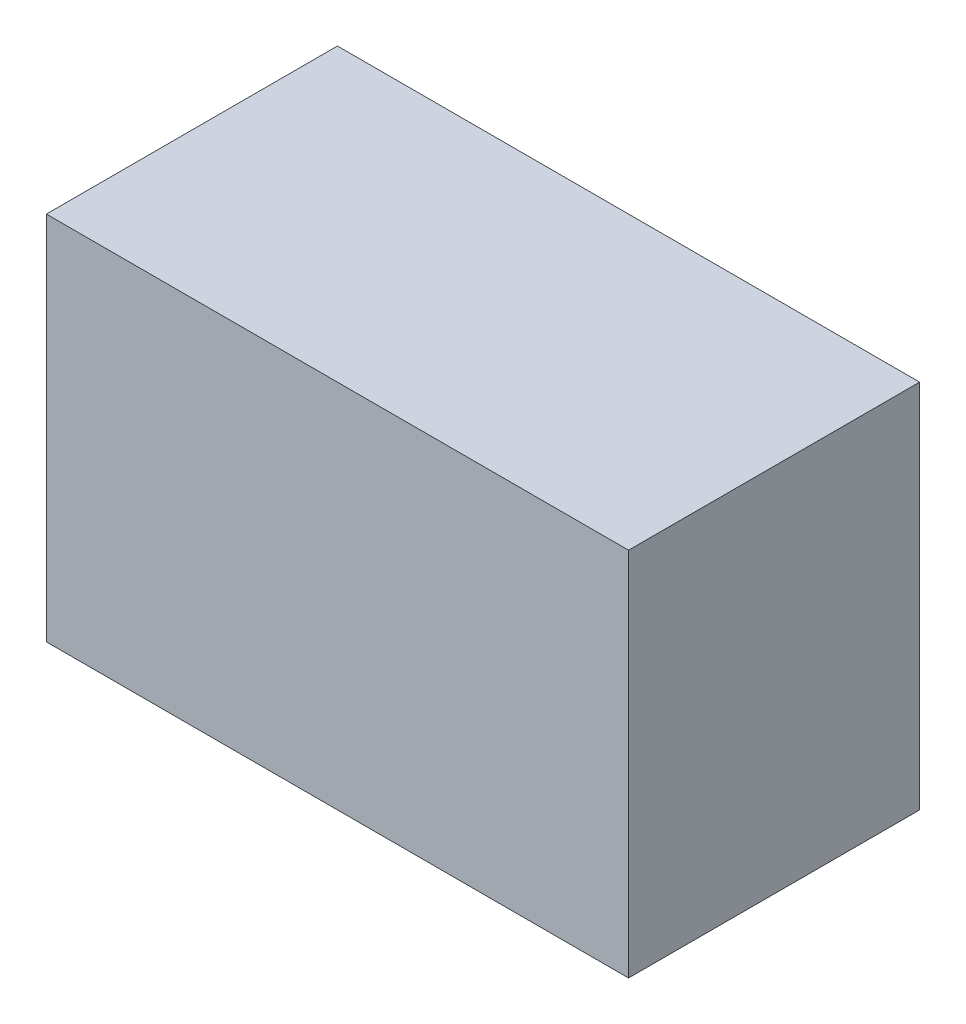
ISO-10303-21;
HEADER;
FILE_DESCRIPTION(('STEP AP214'),'2;1');
FILE_NAME('part.step','',(''),(''),'','','');
FILE_SCHEMA(('AUTOMOTIVE_DESIGN { 1 0 10303 214 1 1 1 1 }'));
ENDSEC;
DATA;
#1=APPLICATION_CONTEXT('core data for automotive mechanical design processes');
#2=APPLICATION_PROTOCOL_DEFINITION('international standard','automotive_design',2000,#1);
#3=PRODUCT_CONTEXT('',#1,'mechanical');
#4=PRODUCT('Part','Part','',(#3));
#5=PRODUCT_RELATED_PRODUCT_CATEGORY('part','',(#4));
#6=PRODUCT_DEFINITION_FORMATION('','',#4);
#7=PRODUCT_DEFINITION_CONTEXT('part definition',#1,'design');
#8=PRODUCT_DEFINITION('design','',#6,#7);
#9=PRODUCT_DEFINITION_SHAPE('','',#8);
#10=(LENGTH_UNIT() NAMED_UNIT(*) SI_UNIT(.MILLI.,.METRE.));
#11=(NAMED_UNIT(*) PLANE_ANGLE_UNIT() SI_UNIT($,.RADIAN.));
#12=(NAMED_UNIT(*) SI_UNIT($,.STERADIAN.) SOLID_ANGLE_UNIT());
#13=UNCERTAINTY_MEASURE_WITH_UNIT(LENGTH_MEASURE(1.E-05),#10,'distance_accuracy_value','');
#14=(GEOMETRIC_REPRESENTATION_CONTEXT(3) GLOBAL_UNCERTAINTY_ASSIGNED_CONTEXT((#13)) GLOBAL_UNIT_ASSIGNED_CONTEXT((#10,
#11,#12)) REPRESENTATION_CONTEXT('',''));
#15=CARTESIAN_POINT('',(0.,0.,0.));
#16=DIRECTION('',(0.,0.,1.));
#17=DIRECTION('',(1.,0.,0.));
#18=AXIS2_PLACEMENT_3D('',#15,#16,#17);
#19=CARTESIAN_POINT('',(0.55000144,-0.3499993,0.5499989));
#20=DIRECTION('',(0.,0.,-1.));
#21=DIRECTION('',(-1.,0.,0.));
#22=AXIS2_PLACEMENT_3D('',#19,#20,#21);
#23=PLANE('',#22);
#24=DIRECTION('',(1.,0.,0.));
#25=VECTOR('',#24,1.);
#26=CARTESIAN_POINT('',(0.55000144,0.35000184,0.5499989));
#27=LINE('',#26,#25);
#28=CARTESIAN_POINT('',(0.55000144,0.35000184,0.5499989));
#29=VERTEX_POINT('',#28);
#30=CARTESIAN_POINT('',(-0.5499989,0.35000184,0.5499989));
#31=VERTEX_POINT('',#30);
#32=EDGE_CURVE('E54',#29,#31,#27,.F.);
#33=ORIENTED_EDGE('',*,*,#32,.T.);
#34=DIRECTION('',(0.,1.,0.));
#35=VECTOR('',#34,1.);
#36=CARTESIAN_POINT('',(-0.5499989,0.35000184,0.5499989));
#37=LINE('',#36,#35);
#38=CARTESIAN_POINT('',(-0.5499989,-0.3499993,0.5499989));
#39=VERTEX_POINT('',#38);
#40=EDGE_CURVE('E56',#31,#39,#37,.F.);
#41=ORIENTED_EDGE('',*,*,#40,.T.);
#42=DIRECTION('',(1.,0.,0.));
#43=VECTOR('',#42,1.);
#44=CARTESIAN_POINT('',(-0.5499989,-0.3499993,0.5499989));
#45=LINE('',#44,#43);
#46=CARTESIAN_POINT('',(0.55000144,-0.3499993,0.5499989));
#47=VERTEX_POINT('',#46);
#48=EDGE_CURVE('E19',#39,#47,#45,.T.);
#49=ORIENTED_EDGE('',*,*,#48,.T.);
#50=DIRECTION('',(0.,1.,0.));
#51=VECTOR('',#50,1.);
#52=CARTESIAN_POINT('',(0.55000144,-0.3499993,0.5499989));
#53=LINE('',#52,#51);
#54=EDGE_CURVE('E79',#47,#29,#53,.T.);
#55=ORIENTED_EDGE('',*,*,#54,.T.);
#56=EDGE_LOOP('',(#33,#41,#49,#55));
#57=FACE_BOUND('',#56,.T.);
#58=ADVANCED_FACE('F16',(#57),#23,.F.);
#59=CARTESIAN_POINT('',(-0.5499989,-0.3499993,0.));
#60=DIRECTION('',(0.,1.,0.));
#61=DIRECTION('',(0.,0.,1.));
#62=AXIS2_PLACEMENT_3D('',#59,#60,#61);
#63=PLANE('',#62);
#64=DIRECTION('',(0.,0.,1.));
#65=VECTOR('',#64,1.);
#66=CARTESIAN_POINT('',(0.55000144,-0.3499993,0.));
#67=LINE('',#66,#65);
#68=CARTESIAN_POINT('',(0.55000144,-0.3499993,0.));
#69=VERTEX_POINT('',#68);
#70=EDGE_CURVE('E67',#69,#47,#67,.T.);
#71=ORIENTED_EDGE('',*,*,#70,.T.);
#72=ORIENTED_EDGE('',*,*,#48,.F.);
#73=DIRECTION('',(0.,0.,-1.));
#74=VECTOR('',#73,1.);
#75=CARTESIAN_POINT('',(-0.5499989,-0.3499993,0.));
#76=LINE('',#75,#74);
#77=CARTESIAN_POINT('',(-0.5499989,-0.3499993,0.));
#78=VERTEX_POINT('',#77);
#79=EDGE_CURVE('E62',#39,#78,#76,.T.);
#80=ORIENTED_EDGE('',*,*,#79,.T.);
#81=DIRECTION('',(-1.,0.,0.));
#82=VECTOR('',#81,1.);
#83=CARTESIAN_POINT('',(0.55000144,-0.3499993,0.));
#84=LINE('',#83,#82);
#85=EDGE_CURVE('E82',#69,#78,#84,.T.);
#86=ORIENTED_EDGE('',*,*,#85,.F.);
#87=EDGE_LOOP('',(#71,#72,#80,#86));
#88=FACE_BOUND('',#87,.T.);
#89=ADVANCED_FACE('F64',(#88),#63,.F.);
#90=CARTESIAN_POINT('',(-0.5499989,0.35000184,0.));
#91=DIRECTION('',(1.,0.,0.));
#92=DIRECTION('',(0.,0.,-1.));
#93=AXIS2_PLACEMENT_3D('',#90,#91,#92);
#94=PLANE('',#93);
#95=ORIENTED_EDGE('',*,*,#79,.F.);
#96=ORIENTED_EDGE('',*,*,#40,.F.);
#97=DIRECTION('',(0.,0.,-1.));
#98=VECTOR('',#97,1.);
#99=CARTESIAN_POINT('',(-0.5499989,0.35000184,0.));
#100=LINE('',#99,#98);
#101=CARTESIAN_POINT('',(-0.5499989,0.35000184,0.));
#102=VERTEX_POINT('',#101);
#103=EDGE_CURVE('E74',#31,#102,#100,.T.);
#104=ORIENTED_EDGE('',*,*,#103,.T.);
#105=DIRECTION('',(0.,1.,0.));
#106=VECTOR('',#105,1.);
#107=CARTESIAN_POINT('',(-0.5499989,-0.3499993,0.));
#108=LINE('',#107,#106);
#109=EDGE_CURVE('E71',#78,#102,#108,.T.);
#110=ORIENTED_EDGE('',*,*,#109,.F.);
#111=EDGE_LOOP('',(#95,#96,#104,#110));
#112=FACE_BOUND('',#111,.T.);
#113=ADVANCED_FACE('F69',(#112),#94,.F.);
#114=CARTESIAN_POINT('',(0.55000144,0.35000184,0.));
#115=DIRECTION('',(0.,-1.,0.));
#116=DIRECTION('',(0.,0.,-1.));
#117=AXIS2_PLACEMENT_3D('',#114,#115,#116);
#118=PLANE('',#117);
#119=ORIENTED_EDGE('',*,*,#103,.F.);
#120=ORIENTED_EDGE('',*,*,#32,.F.);
#121=DIRECTION('',(0.,0.,1.));
#122=VECTOR('',#121,1.);
#123=CARTESIAN_POINT('',(0.55000144,0.35000184,0.));
#124=LINE('',#123,#122);
#125=CARTESIAN_POINT('',(0.55000144,0.35000184,0.));
#126=VERTEX_POINT('',#125);
#127=EDGE_CURVE('E34',#29,#126,#124,.F.);
#128=ORIENTED_EDGE('',*,*,#127,.T.);
#129=DIRECTION('',(-1.,0.,0.));
#130=VECTOR('',#129,1.);
#131=CARTESIAN_POINT('',(0.55000144,0.35000184,0.));
#132=LINE('',#131,#130);
#133=EDGE_CURVE('E25',#102,#126,#132,.F.);
#134=ORIENTED_EDGE('',*,*,#133,.F.);
#135=EDGE_LOOP('',(#119,#120,#128,#134));
#136=FACE_BOUND('',#135,.T.);
#137=ADVANCED_FACE('F88',(#136),#118,.F.);
#138=CARTESIAN_POINT('',(0.55000144,-0.3499993,0.));
#139=DIRECTION('',(-1.,0.,0.));
#140=DIRECTION('',(0.,0.,1.));
#141=AXIS2_PLACEMENT_3D('',#138,#139,#140);
#142=PLANE('',#141);
#143=ORIENTED_EDGE('',*,*,#127,.F.);
#144=ORIENTED_EDGE('',*,*,#54,.F.);
#145=ORIENTED_EDGE('',*,*,#70,.F.);
#146=DIRECTION('',(0.,1.,0.));
#147=VECTOR('',#146,1.);
#148=CARTESIAN_POINT('',(0.55000144,-0.3499993,0.));
#149=LINE('',#148,#147);
#150=EDGE_CURVE('E11',#126,#69,#149,.F.);
#151=ORIENTED_EDGE('',*,*,#150,.F.);
#152=EDGE_LOOP('',(#143,#144,#145,#151));
#153=FACE_BOUND('',#152,.T.);
#154=ADVANCED_FACE('F90',(#153),#142,.F.);
#155=CARTESIAN_POINT('',(0.55000144,-0.3499993,0.));
#156=DIRECTION('',(0.,0.,-1.));
#157=DIRECTION('',(-1.,0.,0.));
#158=AXIS2_PLACEMENT_3D('',#155,#156,#157);
#159=PLANE('',#158);
#160=ORIENTED_EDGE('',*,*,#133,.T.);
#161=ORIENTED_EDGE('',*,*,#150,.T.);
#162=ORIENTED_EDGE('',*,*,#85,.T.);
#163=ORIENTED_EDGE('',*,*,#109,.T.);
#164=EDGE_LOOP('',(#160,#161,#162,#163));
#165=FACE_BOUND('',#164,.T.);
#166=ADVANCED_FACE('F87',(#165),#159,.T.);
#167=CLOSED_SHELL('',(#58,#89,#113,#137,#154,#166));
#168=MANIFOLD_SOLID_BREP('B1',#167);
#169=ADVANCED_BREP_SHAPE_REPRESENTATION('',(#18,#168),#14);
#170=SHAPE_DEFINITION_REPRESENTATION(#9,#169);
ENDSEC;
END-ISO-10303-21;
